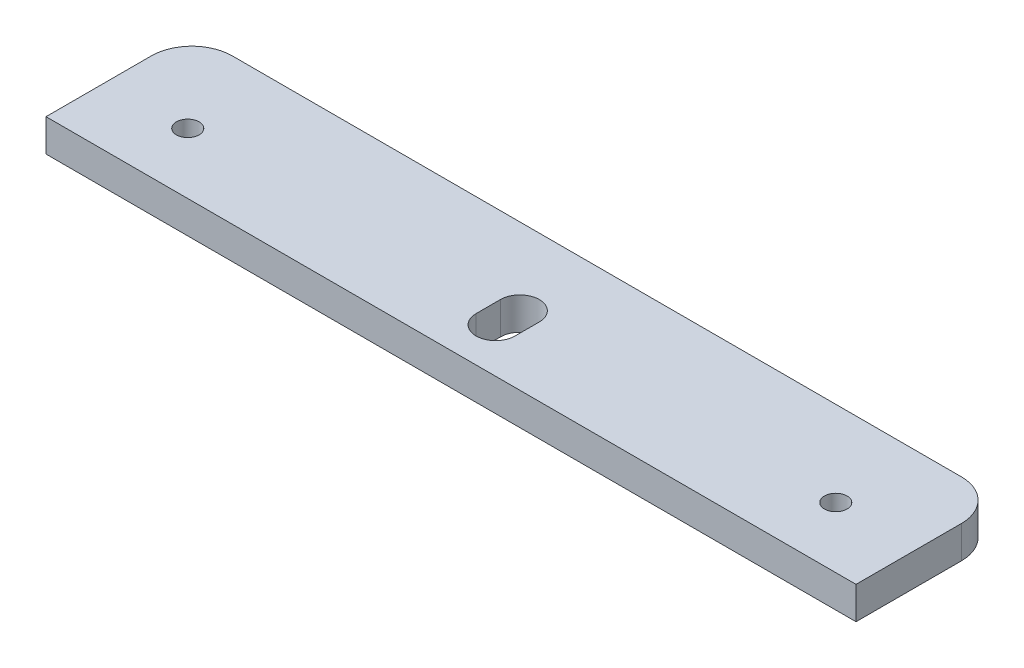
from build123d import *

# Parameters (mm, degrees)
SKETCH1_W              = 63.5
SKETCH1_H              = 22.86
PLATE_DEPTH            = 5.08
FILLET1_R              = 6.35
MONITORSCREWHOLE_DEPTH = 68.68039598
SKETCH3_R              = 1.778
F_8_32TAPHOLES_DEPTH   = 68.68039598
FILLET1_OF_MIRROR1_R   = 6.35


with BuildPart() as part:
    # Sketch1 → Plate (new body)
    with BuildSketch(Plane(origin=(0, 0, 0), x_dir=(1, 0, 0), z_dir=(0, 1, 0))):
        with Locations((-31.75, 11.43)):
            Rectangle(SKETCH1_W, SKETCH1_H)
    plate = extrude(amount=PLATE_DEPTH)

    # Fillet1
    fillet1_edges = [part.edges().sort_by_distance(p)[0] for p in [
        (-63.5, 2.54, -22.86),
    ]]
    fillet(fillet1_edges, radius=FILLET1_R)

    # Sketch2 → MonitorScrewHole (cut, through all)
    with BuildSketch(Plane(origin=(0, 5.08, 0), x_dir=(1, 0, 0), z_dir=(0, 1, 0))):
        with BuildLine():
            Line((3.048, 10.795), (3.048, 6.985))
            ThreePointArc((3.048, 6.985), (0, 3.937), (-3.048, 6.985))
            Line((-3.048, 6.985), (-3.048, 10.795))
            ThreePointArc((-3.048, 10.795), (0, 13.843), (3.048, 10.795))
        make_face()
    monitorscrewhole = extrude(amount=-MONITORSCREWHOLE_DEPTH, mode=Mode.SUBTRACT)

    # Sketch3 → 8-32TapHoles (cut, through all)
    with BuildSketch(Plane(origin=(0, 5.08, 0), x_dir=(1, 0, 0), z_dir=(0, 1, 0))):
        with Locations(Location((-50.8, 9.525, 0), (0, 0, 270))):
            Circle(SKETCH3_R)
    f_8_32tapholes = extrude(amount=-F_8_32TAPHOLES_DEPTH, mode=Mode.SUBTRACT)

    # Mirror1: Plate, MonitorScrewHole, 8-32TapHoles across plane
    add(plate.mirror(Plane(origin=(0, 5.08, 0), x_dir=(0, 0, 1), z_dir=(-1, 0, 0))))
    add(monitorscrewhole.mirror(Plane(origin=(0, 5.08, 0), x_dir=(0, 0, 1), z_dir=(-1, 0, 0))), mode=Mode.SUBTRACT)
    add(f_8_32tapholes.mirror(Plane(origin=(0, 5.08, 0), x_dir=(0, 0, 1), z_dir=(-1, 0, 0))), mode=Mode.SUBTRACT)

    # Fillet1 of Mirror1
    fillet1_of_mirror1_edges = [part.edges().sort_by_distance(p)[0] for p in [
        (63.5, 2.54, -22.86),
    ]]
    fillet(fillet1_of_mirror1_edges, radius=FILLET1_OF_MIRROR1_R)


solid = part.part
